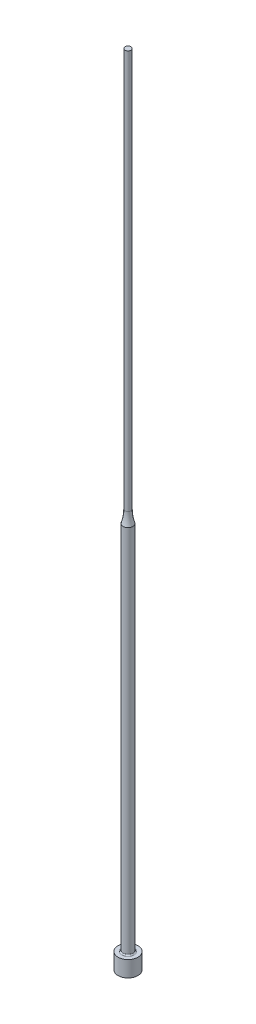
ISO-10303-21;
HEADER;
FILE_DESCRIPTION(('STEP AP214'),'2;1');
FILE_NAME('part.step','',(''),(''),'','','');
FILE_SCHEMA(('AUTOMOTIVE_DESIGN { 1 0 10303 214 1 1 1 1 }'));
ENDSEC;
DATA;
#1=APPLICATION_CONTEXT('core data for automotive mechanical design processes');
#2=APPLICATION_PROTOCOL_DEFINITION('international standard','automotive_design',2000,#1);
#3=PRODUCT_CONTEXT('',#1,'mechanical');
#4=PRODUCT('Part','Part','',(#3));
#5=PRODUCT_RELATED_PRODUCT_CATEGORY('part','',(#4));
#6=PRODUCT_DEFINITION_FORMATION('','',#4);
#7=PRODUCT_DEFINITION_CONTEXT('part definition',#1,'design');
#8=PRODUCT_DEFINITION('design','',#6,#7);
#9=PRODUCT_DEFINITION_SHAPE('','',#8);
#10=(LENGTH_UNIT() NAMED_UNIT(*) SI_UNIT(.MILLI.,.METRE.));
#11=(NAMED_UNIT(*) PLANE_ANGLE_UNIT() SI_UNIT($,.RADIAN.));
#12=(NAMED_UNIT(*) SI_UNIT($,.STERADIAN.) SOLID_ANGLE_UNIT());
#13=UNCERTAINTY_MEASURE_WITH_UNIT(LENGTH_MEASURE(1.E-05),#10,'distance_accuracy_value','');
#14=(GEOMETRIC_REPRESENTATION_CONTEXT(3) GLOBAL_UNCERTAINTY_ASSIGNED_CONTEXT((#13)) GLOBAL_UNIT_ASSIGNED_CONTEXT((#10,
#11,#12)) REPRESENTATION_CONTEXT('',''));
#15=CARTESIAN_POINT('',(0.,0.,0.));
#16=DIRECTION('',(0.,0.,1.));
#17=DIRECTION('',(1.,0.,0.));
#18=AXIS2_PLACEMENT_3D('',#15,#16,#17);
#19=CARTESIAN_POINT('',(0.750000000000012,200.,0.));
#20=DIRECTION('',(0.,-1.,0.));
#21=DIRECTION('',(1.,0.,0.));
#22=AXIS2_PLACEMENT_3D('',#19,#20,#21);
#23=PLANE('',#22);
#24=CARTESIAN_POINT('',(0.,200.,0.));
#25=DIRECTION('',(0.,1.,0.));
#26=DIRECTION('',(-1.,0.,0.));
#27=AXIS2_PLACEMENT_3D('',#24,#25,#26);
#28=CIRCLE('',#27,0.750000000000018);
#29=CARTESIAN_POINT('',(-0.750000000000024,200.,0.));
#30=VERTEX_POINT('',#29);
#31=EDGE_CURVE('E10',#30,#30,#28,.T.);
#32=ORIENTED_EDGE('',*,*,#31,.T.);
#33=EDGE_LOOP('',(#32));
#34=FACE_BOUND('',#33,.T.);
#35=ADVANCED_FACE('F30',(#34),#23,.F.);
#36=CARTESIAN_POINT('',(0.,200.,0.));
#37=DIRECTION('',(0.,1.,0.));
#38=DIRECTION('',(-1.,0.,0.));
#39=AXIS2_PLACEMENT_3D('',#36,#37,#38);
#40=CYLINDRICAL_SURFACE('',#39,0.750000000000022);
#41=ORIENTED_EDGE('',*,*,#31,.F.);
#42=EDGE_LOOP('',(#41));
#43=FACE_BOUND('',#42,.T.);
#44=CARTESIAN_POINT('',(0.,100.,0.));
#45=DIRECTION('',(0.,1.,0.));
#46=DIRECTION('',(-1.,0.,0.));
#47=AXIS2_PLACEMENT_3D('',#44,#45,#46);
#48=CIRCLE('',#47,0.750000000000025);
#49=CARTESIAN_POINT('',(-0.750000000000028,100.,0.));
#50=VERTEX_POINT('',#49);
#51=EDGE_CURVE('E36',#50,#50,#48,.T.);
#52=ORIENTED_EDGE('',*,*,#51,.T.);
#53=EDGE_LOOP('',(#52));
#54=FACE_BOUND('',#53,.T.);
#55=ADVANCED_FACE('F71',(#43,#54),#40,.T.);
#56=CARTESIAN_POINT('',(0.,100.,0.));
#57=DIRECTION('',(0.,1.,0.));
#58=DIRECTION('',(-1.,0.,0.));
#59=AXIS2_PLACEMENT_3D('',#56,#57,#58);
#60=TOROIDAL_SURFACE('',#59,10.75,10.);
#61=ORIENTED_EDGE('',*,*,#51,.F.);
#62=EDGE_LOOP('',(#61));
#63=FACE_BOUND('',#62,.T.);
#64=CARTESIAN_POINT('',(0.,96.8775010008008,0.));
#65=DIRECTION('',(0.,1.,0.));
#66=DIRECTION('',(-1.,0.,0.));
#67=AXIS2_PLACEMENT_3D('',#64,#65,#66);
#68=CIRCLE('',#67,1.25000000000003);
#69=CARTESIAN_POINT('',(-1.25000000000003,96.8775010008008,0.));
#70=VERTEX_POINT('',#69);
#71=EDGE_CURVE('E40',#70,#70,#68,.T.);
#72=ORIENTED_EDGE('',*,*,#71,.T.);
#73=EDGE_LOOP('',(#72));
#74=FACE_BOUND('',#73,.T.);
#75=ADVANCED_FACE('F75',(#63,#74),#60,.F.);
#76=CARTESIAN_POINT('',(0.,200.,0.));
#77=DIRECTION('',(0.,1.,0.));
#78=DIRECTION('',(-1.,0.,0.));
#79=AXIS2_PLACEMENT_3D('',#76,#77,#78);
#80=CYLINDRICAL_SURFACE('',#79,1.25000000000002);
#81=ORIENTED_EDGE('',*,*,#71,.F.);
#82=EDGE_LOOP('',(#81));
#83=FACE_BOUND('',#82,.T.);
#84=CARTESIAN_POINT('',(0.,4.3,0.));
#85=DIRECTION('',(0.,1.,0.));
#86=DIRECTION('',(-1.,0.,0.));
#87=AXIS2_PLACEMENT_3D('',#84,#85,#86);
#88=CIRCLE('',#87,1.25000000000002);
#89=CARTESIAN_POINT('',(-1.25000000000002,4.3,0.));
#90=VERTEX_POINT('',#89);
#91=EDGE_CURVE('E44',#90,#90,#88,.T.);
#92=ORIENTED_EDGE('',*,*,#91,.T.);
#93=EDGE_LOOP('',(#92));
#94=FACE_BOUND('',#93,.T.);
#95=ADVANCED_FACE('F80',(#83,#94),#80,.T.);
#96=CARTESIAN_POINT('',(0.,4.3,0.));
#97=DIRECTION('',(0.,1.,0.));
#98=DIRECTION('',(-1.,0.,0.));
#99=AXIS2_PLACEMENT_3D('',#96,#97,#98);
#100=TOROIDAL_SURFACE('',#99,1.55000000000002,0.3);
#101=ORIENTED_EDGE('',*,*,#91,.F.);
#102=EDGE_LOOP('',(#101));
#103=FACE_BOUND('',#102,.T.);
#104=CARTESIAN_POINT('',(0.,4.,0.));
#105=DIRECTION('',(0.,1.,0.));
#106=DIRECTION('',(-1.,0.,0.));
#107=AXIS2_PLACEMENT_3D('',#104,#105,#106);
#108=CIRCLE('',#107,1.55000000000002);
#109=CARTESIAN_POINT('',(-1.55000000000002,4.,0.));
#110=VERTEX_POINT('',#109);
#111=EDGE_CURVE('E49',#110,#110,#108,.T.);
#112=ORIENTED_EDGE('',*,*,#111,.T.);
#113=EDGE_LOOP('',(#112));
#114=FACE_BOUND('',#113,.T.);
#115=ADVANCED_FACE('F86',(#103,#114),#100,.F.);
#116=CARTESIAN_POINT('',(2.50000000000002,4.,0.));
#117=DIRECTION('',(0.,-1.,0.));
#118=DIRECTION('',(1.,0.,0.));
#119=AXIS2_PLACEMENT_3D('',#116,#117,#118);
#120=PLANE('',#119);
#121=ORIENTED_EDGE('',*,*,#111,.F.);
#122=EDGE_LOOP('',(#121));
#123=FACE_BOUND('',#122,.T.);
#124=CARTESIAN_POINT('',(0.,4.,0.));
#125=DIRECTION('',(0.,1.,0.));
#126=DIRECTION('',(-1.,0.,0.));
#127=AXIS2_PLACEMENT_3D('',#124,#125,#126);
#128=CIRCLE('',#127,2.50000000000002);
#129=CARTESIAN_POINT('',(-2.50000000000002,4.,0.));
#130=VERTEX_POINT('',#129);
#131=EDGE_CURVE('E52',#130,#130,#128,.T.);
#132=ORIENTED_EDGE('',*,*,#131,.T.);
#133=EDGE_LOOP('',(#132));
#134=FACE_BOUND('',#133,.T.);
#135=ADVANCED_FACE('F67',(#123,#134),#120,.F.);
#136=CARTESIAN_POINT('',(0.,200.,0.));
#137=DIRECTION('',(0.,1.,0.));
#138=DIRECTION('',(-1.,0.,0.));
#139=AXIS2_PLACEMENT_3D('',#136,#137,#138);
#140=CYLINDRICAL_SURFACE('',#139,2.50000000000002);
#141=ORIENTED_EDGE('',*,*,#131,.F.);
#142=EDGE_LOOP('',(#141));
#143=FACE_BOUND('',#142,.T.);
#144=CARTESIAN_POINT('',(0.,0.,0.));
#145=DIRECTION('',(0.,1.,0.));
#146=DIRECTION('',(-1.,0.,0.));
#147=AXIS2_PLACEMENT_3D('',#144,#145,#146);
#148=CIRCLE('',#147,2.50000000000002);
#149=CARTESIAN_POINT('',(-2.50000000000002,0.,0.));
#150=VERTEX_POINT('',#149);
#151=EDGE_CURVE('E55',#150,#150,#148,.T.);
#152=ORIENTED_EDGE('',*,*,#151,.T.);
#153=EDGE_LOOP('',(#152));
#154=FACE_BOUND('',#153,.T.);
#155=ADVANCED_FACE('F59',(#143,#154),#140,.T.);
#156=CARTESIAN_POINT('',(0.,0.,0.));
#157=DIRECTION('',(0.,1.,0.));
#158=DIRECTION('',(-1.,0.,0.));
#159=AXIS2_PLACEMENT_3D('',#156,#157,#158);
#160=PLANE('',#159);
#161=ORIENTED_EDGE('',*,*,#151,.F.);
#162=EDGE_LOOP('',(#161));
#163=FACE_BOUND('',#162,.T.);
#164=ADVANCED_FACE('F61',(#163),#160,.F.);
#165=CLOSED_SHELL('',(#35,#55,#75,#95,#115,#135,#155,#164));
#166=MANIFOLD_SOLID_BREP('B2',#165);
#167=ADVANCED_BREP_SHAPE_REPRESENTATION('',(#18,#166),#14);
#168=SHAPE_DEFINITION_REPRESENTATION(#9,#167);
ENDSEC;
END-ISO-10303-21;
